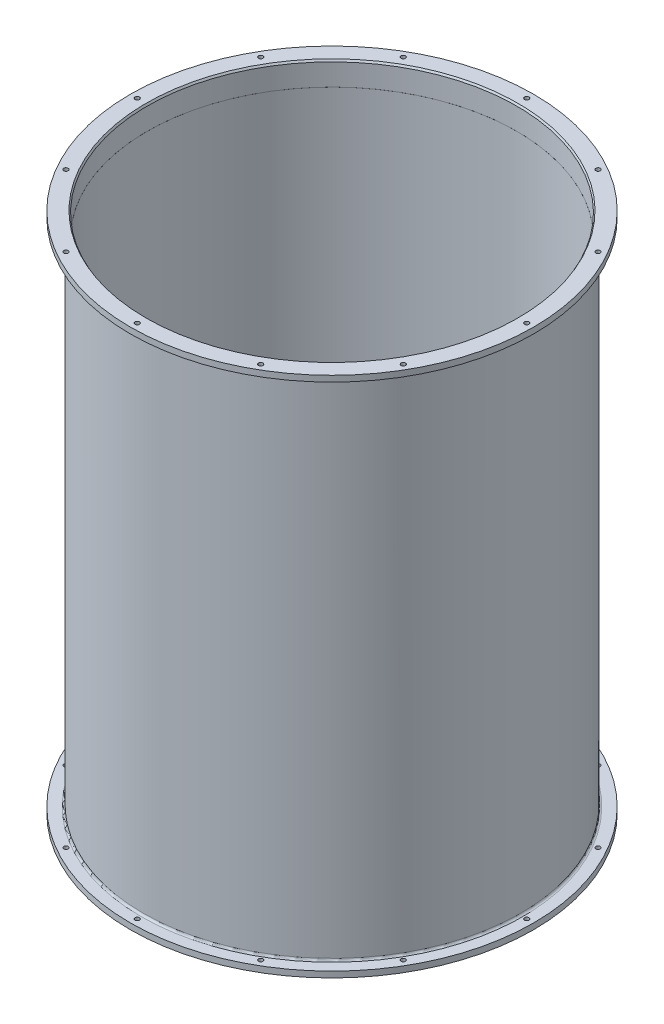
ISO-10303-21;
HEADER;
FILE_DESCRIPTION(('STEP AP214'),'2;1');
FILE_NAME('part.step','',(''),(''),'','','');
FILE_SCHEMA(('AUTOMOTIVE_DESIGN { 1 0 10303 214 1 1 1 1 }'));
ENDSEC;
DATA;
#1=APPLICATION_CONTEXT('core data for automotive mechanical design processes');
#2=APPLICATION_PROTOCOL_DEFINITION('international standard','automotive_design',2000,#1);
#3=PRODUCT_CONTEXT('',#1,'mechanical');
#4=PRODUCT('Part','Part','',(#3));
#5=PRODUCT_RELATED_PRODUCT_CATEGORY('part','',(#4));
#6=PRODUCT_DEFINITION_FORMATION('','',#4);
#7=PRODUCT_DEFINITION_CONTEXT('part definition',#1,'design');
#8=PRODUCT_DEFINITION('design','',#6,#7);
#9=PRODUCT_DEFINITION_SHAPE('','',#8);
#10=(LENGTH_UNIT() NAMED_UNIT(*) SI_UNIT(.MILLI.,.METRE.));
#11=(NAMED_UNIT(*) PLANE_ANGLE_UNIT() SI_UNIT($,.RADIAN.));
#12=(NAMED_UNIT(*) SI_UNIT($,.STERADIAN.) SOLID_ANGLE_UNIT());
#13=UNCERTAINTY_MEASURE_WITH_UNIT(LENGTH_MEASURE(1.E-05),#10,'distance_accuracy_value','');
#14=(GEOMETRIC_REPRESENTATION_CONTEXT(3) GLOBAL_UNCERTAINTY_ASSIGNED_CONTEXT((#13)) GLOBAL_UNIT_ASSIGNED_CONTEXT((#10,
#11,#12)) REPRESENTATION_CONTEXT('',''));
#15=CARTESIAN_POINT('',(0.,0.,0.));
#16=DIRECTION('',(0.,0.,1.));
#17=DIRECTION('',(1.,0.,0.));
#18=AXIS2_PLACEMENT_3D('',#15,#16,#17);
#19=CARTESIAN_POINT('',(0.,86.36,0.));
#20=DIRECTION('',(0.,1.,0.));
#21=DIRECTION('',(0.,0.,1.));
#22=AXIS2_PLACEMENT_3D('',#19,#20,#21);
#23=CYLINDRICAL_SURFACE('',#22,296.926);
#24=CARTESIAN_POINT('',(0.,-416.052,0.));
#25=DIRECTION('',(0.,-1.,0.));
#26=DIRECTION('',(0.,0.,-1.));
#27=AXIS2_PLACEMENT_3D('',#24,#25,#26);
#28=CIRCLE('',#27,296.926);
#29=CARTESIAN_POINT('',(0.,-416.052,-296.926));
#30=VERTEX_POINT('',#29);
#31=EDGE_CURVE('E59',#30,#30,#28,.T.);
#32=ORIENTED_EDGE('',*,*,#31,.T.);
#33=EDGE_LOOP('',(#32));
#34=FACE_BOUND('',#33,.T.);
#35=CARTESIAN_POINT('',(0.,-381.,0.));
#36=DIRECTION('',(0.,1.,0.));
#37=DIRECTION('',(0.,0.,1.));
#38=AXIS2_PLACEMENT_3D('',#35,#36,#37);
#39=CIRCLE('',#38,296.926);
#40=CARTESIAN_POINT('',(0.,-381.,296.926));
#41=VERTEX_POINT('',#40);
#42=EDGE_CURVE('E86',#41,#41,#39,.T.);
#43=ORIENTED_EDGE('',*,*,#42,.T.);
#44=EDGE_LOOP('',(#43));
#45=FACE_BOUND('',#44,.T.);
#46=ADVANCED_FACE('F34',(#34,#45),#23,.F.);
#47=CARTESIAN_POINT('',(-296.926,-419.1,0.));
#48=DIRECTION('',(0.,-1.,0.));
#49=DIRECTION('',(0.,0.,-1.));
#50=AXIS2_PLACEMENT_3D('',#47,#48,#49);
#51=PLANE('',#50);
#52=CARTESIAN_POINT('',(0.,-419.1,0.));
#53=DIRECTION('',(0.,-1.,0.));
#54=DIRECTION('',(0.,0.,-1.));
#55=AXIS2_PLACEMENT_3D('',#52,#53,#54);
#56=CIRCLE('',#55,298.68576362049);
#57=CARTESIAN_POINT('',(0.,-419.1,-298.68576362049));
#58=VERTEX_POINT('',#57);
#59=EDGE_CURVE('E62',#58,#58,#56,.F.);
#60=ORIENTED_EDGE('',*,*,#59,.T.);
#61=EDGE_LOOP('',(#60));
#62=FACE_BOUND('',#61,.T.);
#63=CARTESIAN_POINT('',(156.368749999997,-419.1,270.838619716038));
#64=DIRECTION('',(0.,1.,0.));
#65=DIRECTION('',(0.499999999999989,0.,0.866025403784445));
#66=AXIS2_PLACEMENT_3D('',#63,#64,#65);
#67=CIRCLE('',#66,3.55599999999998);
#68=CARTESIAN_POINT('',(158.146749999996,-419.1,273.918206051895));
#69=VERTEX_POINT('',#68);
#70=EDGE_CURVE('E227',#69,#69,#67,.T.);
#71=ORIENTED_EDGE('',*,*,#70,.T.);
#72=EDGE_LOOP('',(#71));
#73=FACE_BOUND('',#72,.T.);
#74=CARTESIAN_POINT('',(270.838619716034,-419.1,156.368750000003));
#75=DIRECTION('',(0.,1.,0.));
#76=DIRECTION('',(0.866025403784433,0.,0.50000000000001));
#77=AXIS2_PLACEMENT_3D('',#74,#75,#76);
#78=CIRCLE('',#77,3.55599999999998);
#79=CARTESIAN_POINT('',(273.918206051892,-419.1,158.146750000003));
#80=VERTEX_POINT('',#79);
#81=EDGE_CURVE('E215',#80,#80,#78,.T.);
#82=ORIENTED_EDGE('',*,*,#81,.T.);
#83=EDGE_LOOP('',(#82));
#84=FACE_BOUND('',#83,.T.);
#85=CARTESIAN_POINT('',(312.7375,-419.1,3.27575333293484E-12));
#86=DIRECTION('',(0.,1.,0.));
#87=DIRECTION('',(1.,0.,0.));
#88=AXIS2_PLACEMENT_3D('',#85,#86,#87);
#89=CIRCLE('',#88,3.55599999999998);
#90=CARTESIAN_POINT('',(316.2935,-419.1,3.31300047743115E-12));
#91=VERTEX_POINT('',#90);
#92=EDGE_CURVE('E203',#91,#91,#89,.T.);
#93=ORIENTED_EDGE('',*,*,#92,.T.);
#94=EDGE_LOOP('',(#93));
#95=FACE_BOUND('',#94,.T.);
#96=CARTESIAN_POINT('',(270.838619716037,-419.1,-156.368749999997));
#97=DIRECTION('',(0.,1.,0.));
#98=DIRECTION('',(0.866025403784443,0.,-0.499999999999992));
#99=AXIS2_PLACEMENT_3D('',#96,#97,#98);
#100=CIRCLE('',#99,3.55599999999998);
#101=CARTESIAN_POINT('',(273.918206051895,-419.1,-158.146749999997));
#102=VERTEX_POINT('',#101);
#103=EDGE_CURVE('E191',#102,#102,#100,.T.);
#104=ORIENTED_EDGE('',*,*,#103,.T.);
#105=EDGE_LOOP('',(#104));
#106=FACE_BOUND('',#105,.T.);
#107=CARTESIAN_POINT('',(156.368750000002,-419.1,-270.838619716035));
#108=DIRECTION('',(0.,1.,0.));
#109=DIRECTION('',(0.500000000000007,0.,-0.866025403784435));
#110=AXIS2_PLACEMENT_3D('',#107,#108,#109);
#111=CIRCLE('',#110,3.55599999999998);
#112=CARTESIAN_POINT('',(158.146750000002,-419.1,-273.918206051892));
#113=VERTEX_POINT('',#112);
#114=EDGE_CURVE('E179',#113,#113,#111,.T.);
#115=ORIENTED_EDGE('',*,*,#114,.T.);
#116=EDGE_LOOP('',(#115));
#117=FACE_BOUND('',#116,.T.);
#118=CARTESIAN_POINT('',(2.18383555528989E-12,-419.1,-312.7375));
#119=DIRECTION('',(0.,1.,0.));
#120=DIRECTION('',(0.,0.,-1.));
#121=AXIS2_PLACEMENT_3D('',#118,#119,#120);
#122=CIRCLE('',#121,3.55599999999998);
#123=CARTESIAN_POINT('',(2.2086669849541E-12,-419.1,-316.2935));
#124=VERTEX_POINT('',#123);
#125=EDGE_CURVE('E167',#124,#124,#122,.T.);
#126=ORIENTED_EDGE('',*,*,#125,.T.);
#127=EDGE_LOOP('',(#126));
#128=FACE_BOUND('',#127,.T.);
#129=CARTESIAN_POINT('',(-156.368749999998,-419.1,-270.838619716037));
#130=DIRECTION('',(0.,1.,0.));
#131=DIRECTION('',(-0.499999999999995,0.,-0.866025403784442));
#132=AXIS2_PLACEMENT_3D('',#129,#130,#131);
#133=CIRCLE('',#132,3.55599999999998);
#134=CARTESIAN_POINT('',(-158.146749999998,-419.1,-273.918206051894));
#135=VERTEX_POINT('',#134);
#136=EDGE_CURVE('E155',#135,#135,#133,.T.);
#137=ORIENTED_EDGE('',*,*,#136,.T.);
#138=EDGE_LOOP('',(#137));
#139=FACE_BOUND('',#138,.T.);
#140=CARTESIAN_POINT('',(-270.838619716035,-419.1,-156.368750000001));
#141=DIRECTION('',(0.,1.,0.));
#142=DIRECTION('',(-0.866025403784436,0.,-0.500000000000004));
#143=AXIS2_PLACEMENT_3D('',#140,#141,#142);
#144=CIRCLE('',#143,3.55599999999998);
#145=CARTESIAN_POINT('',(-273.918206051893,-419.1,-158.146750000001));
#146=VERTEX_POINT('',#145);
#147=EDGE_CURVE('E143',#146,#146,#144,.T.);
#148=ORIENTED_EDGE('',*,*,#147,.T.);
#149=EDGE_LOOP('',(#148));
#150=FACE_BOUND('',#149,.T.);
#151=CARTESIAN_POINT('',(-312.7375,-419.1,-1.09191777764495E-12));
#152=DIRECTION('',(0.,1.,0.));
#153=DIRECTION('',(-1.,0.,0.));
#154=AXIS2_PLACEMENT_3D('',#151,#152,#153);
#155=CIRCLE('',#154,3.55599999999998);
#156=CARTESIAN_POINT('',(-316.2935,-419.1,-1.10433349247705E-12));
#157=VERTEX_POINT('',#156);
#158=EDGE_CURVE('E131',#157,#157,#155,.T.);
#159=ORIENTED_EDGE('',*,*,#158,.T.);
#160=EDGE_LOOP('',(#159));
#161=FACE_BOUND('',#160,.T.);
#162=CARTESIAN_POINT('',(-270.838619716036,-419.1,156.368749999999));
#163=DIRECTION('',(0.,1.,0.));
#164=DIRECTION('',(-0.86602540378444,0.,0.499999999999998));
#165=AXIS2_PLACEMENT_3D('',#162,#163,#164);
#166=CIRCLE('',#165,3.55599999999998);
#167=CARTESIAN_POINT('',(-273.918206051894,-419.1,158.146749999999));
#168=VERTEX_POINT('',#167);
#169=EDGE_CURVE('E119',#168,#168,#166,.T.);
#170=ORIENTED_EDGE('',*,*,#169,.T.);
#171=EDGE_LOOP('',(#170));
#172=FACE_BOUND('',#171,.T.);
#173=CARTESIAN_POINT('',(-156.36875,-419.1,270.838619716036));
#174=DIRECTION('',(0.,1.,0.));
#175=DIRECTION('',(-0.500000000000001,0.,0.866025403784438));
#176=AXIS2_PLACEMENT_3D('',#173,#174,#175);
#177=CIRCLE('',#176,3.55599999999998);
#178=CARTESIAN_POINT('',(-158.14675,-419.1,273.918206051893));
#179=VERTEX_POINT('',#178);
#180=EDGE_CURVE('E107',#179,#179,#177,.T.);
#181=ORIENTED_EDGE('',*,*,#180,.T.);
#182=EDGE_LOOP('',(#181));
#183=FACE_BOUND('',#182,.T.);
#184=CARTESIAN_POINT('',(0.,-419.1,312.7375));
#185=DIRECTION('',(0.,1.,0.));
#186=DIRECTION('',(0.,0.,1.));
#187=AXIS2_PLACEMENT_3D('',#184,#185,#186);
#188=CIRCLE('',#187,3.55599999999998);
#189=CARTESIAN_POINT('',(0.,-419.1,316.2935));
#190=VERTEX_POINT('',#189);
#191=EDGE_CURVE('E95',#190,#190,#188,.T.);
#192=ORIENTED_EDGE('',*,*,#191,.T.);
#193=EDGE_LOOP('',(#192));
#194=FACE_BOUND('',#193,.T.);
#195=CARTESIAN_POINT('',(0.,-419.1,0.));
#196=DIRECTION('',(0.,1.,0.));
#197=DIRECTION('',(0.,0.,1.));
#198=AXIS2_PLACEMENT_3D('',#195,#196,#197);
#199=CIRCLE('',#198,323.85);
#200=CARTESIAN_POINT('',(0.,-419.1,323.85));
#201=VERTEX_POINT('',#200);
#202=EDGE_CURVE('E65',#201,#201,#199,.T.);
#203=ORIENTED_EDGE('',*,*,#202,.F.);
#204=EDGE_LOOP('',(#203));
#205=FACE_BOUND('',#204,.T.);
#206=ADVANCED_FACE('F277',(#62,#73,#84,#95,#106,#117,#128,#139,#150,#161,#172,#183,#194,#205),
#51,.T.);
#207=CARTESIAN_POINT('',(0.,86.36,0.));
#208=DIRECTION('',(0.,1.,0.));
#209=DIRECTION('',(0.,0.,1.));
#210=AXIS2_PLACEMENT_3D('',#207,#208,#209);
#211=CYLINDRICAL_SURFACE('',#210,323.85);
#212=ORIENTED_EDGE('',*,*,#202,.T.);
#213=EDGE_LOOP('',(#212));
#214=FACE_BOUND('',#213,.T.);
#215=CARTESIAN_POINT('',(0.,-409.575,0.));
#216=DIRECTION('',(0.,1.,0.));
#217=DIRECTION('',(0.,0.,1.));
#218=AXIS2_PLACEMENT_3D('',#215,#216,#217);
#219=CIRCLE('',#218,323.85);
#220=CARTESIAN_POINT('',(0.,-409.575,323.85));
#221=VERTEX_POINT('',#220);
#222=EDGE_CURVE('E68',#221,#221,#219,.T.);
#223=ORIENTED_EDGE('',*,*,#222,.F.);
#224=EDGE_LOOP('',(#223));
#225=FACE_BOUND('',#224,.T.);
#226=ADVANCED_FACE('F282',(#214,#225),#211,.T.);
#227=CARTESIAN_POINT('',(-323.85,-409.575,0.));
#228=DIRECTION('',(0.,1.,0.));
#229=DIRECTION('',(0.,0.,1.));
#230=AXIS2_PLACEMENT_3D('',#227,#228,#229);
#231=PLANE('',#230);
#232=CARTESIAN_POINT('',(0.,-409.575,0.));
#233=DIRECTION('',(0.,1.,0.));
#234=DIRECTION('',(0.,0.,1.));
#235=AXIS2_PLACEMENT_3D('',#232,#233,#234);
#236=CIRCLE('',#235,306.3875);
#237=CARTESIAN_POINT('',(0.,-409.575,306.3875));
#238=VERTEX_POINT('',#237);
#239=EDGE_CURVE('E44',#238,#238,#236,.F.);
#240=ORIENTED_EDGE('',*,*,#239,.T.);
#241=EDGE_LOOP('',(#240));
#242=FACE_BOUND('',#241,.T.);
#243=CARTESIAN_POINT('',(156.368749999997,-409.575,270.838619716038));
#244=DIRECTION('',(0.,1.,0.));
#245=DIRECTION('',(0.,0.,1.));
#246=AXIS2_PLACEMENT_3D('',#243,#244,#245);
#247=CIRCLE('',#246,3.55599999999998);
#248=CARTESIAN_POINT('',(156.368749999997,-409.575,274.394619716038));
#249=VERTEX_POINT('',#248);
#250=EDGE_CURVE('E221',#249,#249,#247,.T.);
#251=ORIENTED_EDGE('',*,*,#250,.F.);
#252=EDGE_LOOP('',(#251));
#253=FACE_BOUND('',#252,.T.);
#254=CARTESIAN_POINT('',(270.838619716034,-409.575,156.368750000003));
#255=DIRECTION('',(0.,1.,0.));
#256=DIRECTION('',(0.,0.,1.));
#257=AXIS2_PLACEMENT_3D('',#254,#255,#256);
#258=CIRCLE('',#257,3.55599999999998);
#259=CARTESIAN_POINT('',(270.838619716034,-409.575,159.924750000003));
#260=VERTEX_POINT('',#259);
#261=EDGE_CURVE('E209',#260,#260,#258,.T.);
#262=ORIENTED_EDGE('',*,*,#261,.F.);
#263=EDGE_LOOP('',(#262));
#264=FACE_BOUND('',#263,.T.);
#265=CARTESIAN_POINT('',(312.7375,-409.575,3.27575333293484E-12));
#266=DIRECTION('',(0.,1.,0.));
#267=DIRECTION('',(0.,0.,1.));
#268=AXIS2_PLACEMENT_3D('',#265,#266,#267);
#269=CIRCLE('',#268,3.55599999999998);
#270=CARTESIAN_POINT('',(312.7375,-409.575,3.55600000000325));
#271=VERTEX_POINT('',#270);
#272=EDGE_CURVE('E197',#271,#271,#269,.T.);
#273=ORIENTED_EDGE('',*,*,#272,.F.);
#274=EDGE_LOOP('',(#273));
#275=FACE_BOUND('',#274,.T.);
#276=CARTESIAN_POINT('',(270.838619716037,-409.575,-156.368749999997));
#277=DIRECTION('',(0.,1.,0.));
#278=DIRECTION('',(0.,0.,1.));
#279=AXIS2_PLACEMENT_3D('',#276,#277,#278);
#280=CIRCLE('',#279,3.55599999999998);
#281=CARTESIAN_POINT('',(270.838619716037,-409.575,-152.812749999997));
#282=VERTEX_POINT('',#281);
#283=EDGE_CURVE('E185',#282,#282,#280,.T.);
#284=ORIENTED_EDGE('',*,*,#283,.F.);
#285=EDGE_LOOP('',(#284));
#286=FACE_BOUND('',#285,.T.);
#287=CARTESIAN_POINT('',(156.368750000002,-409.575,-270.838619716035));
#288=DIRECTION('',(0.,1.,0.));
#289=DIRECTION('',(0.,0.,1.));
#290=AXIS2_PLACEMENT_3D('',#287,#288,#289);
#291=CIRCLE('',#290,3.55599999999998);
#292=CARTESIAN_POINT('',(156.368750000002,-409.575,-267.282619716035));
#293=VERTEX_POINT('',#292);
#294=EDGE_CURVE('E173',#293,#293,#291,.T.);
#295=ORIENTED_EDGE('',*,*,#294,.F.);
#296=EDGE_LOOP('',(#295));
#297=FACE_BOUND('',#296,.T.);
#298=CARTESIAN_POINT('',(2.18383555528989E-12,-409.575,-312.7375));
#299=DIRECTION('',(0.,1.,0.));
#300=DIRECTION('',(0.,0.,1.));
#301=AXIS2_PLACEMENT_3D('',#298,#299,#300);
#302=CIRCLE('',#301,3.55599999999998);
#303=CARTESIAN_POINT('',(2.18383555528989E-12,-409.575,-309.1815));
#304=VERTEX_POINT('',#303);
#305=EDGE_CURVE('E161',#304,#304,#302,.T.);
#306=ORIENTED_EDGE('',*,*,#305,.F.);
#307=EDGE_LOOP('',(#306));
#308=FACE_BOUND('',#307,.T.);
#309=CARTESIAN_POINT('',(-156.368749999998,-409.575,-270.838619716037));
#310=DIRECTION('',(0.,1.,0.));
#311=DIRECTION('',(0.,0.,1.));
#312=AXIS2_PLACEMENT_3D('',#309,#310,#311);
#313=CIRCLE('',#312,3.55599999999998);
#314=CARTESIAN_POINT('',(-156.368749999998,-409.575,-267.282619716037));
#315=VERTEX_POINT('',#314);
#316=EDGE_CURVE('E149',#315,#315,#313,.T.);
#317=ORIENTED_EDGE('',*,*,#316,.F.);
#318=EDGE_LOOP('',(#317));
#319=FACE_BOUND('',#318,.T.);
#320=CARTESIAN_POINT('',(-270.838619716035,-409.575,-156.368750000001));
#321=DIRECTION('',(0.,1.,0.));
#322=DIRECTION('',(0.,0.,1.));
#323=AXIS2_PLACEMENT_3D('',#320,#321,#322);
#324=CIRCLE('',#323,3.55599999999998);
#325=CARTESIAN_POINT('',(-270.838619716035,-409.575,-152.812750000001));
#326=VERTEX_POINT('',#325);
#327=EDGE_CURVE('E137',#326,#326,#324,.T.);
#328=ORIENTED_EDGE('',*,*,#327,.F.);
#329=EDGE_LOOP('',(#328));
#330=FACE_BOUND('',#329,.T.);
#331=CARTESIAN_POINT('',(-312.7375,-409.575,-1.09191777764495E-12));
#332=DIRECTION('',(0.,1.,0.));
#333=DIRECTION('',(0.,0.,1.));
#334=AXIS2_PLACEMENT_3D('',#331,#332,#333);
#335=CIRCLE('',#334,3.55599999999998);
#336=CARTESIAN_POINT('',(-312.7375,-409.575,3.55599999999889));
#337=VERTEX_POINT('',#336);
#338=EDGE_CURVE('E125',#337,#337,#335,.T.);
#339=ORIENTED_EDGE('',*,*,#338,.F.);
#340=EDGE_LOOP('',(#339));
#341=FACE_BOUND('',#340,.T.);
#342=CARTESIAN_POINT('',(-270.838619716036,-409.575,156.368749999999));
#343=DIRECTION('',(0.,1.,0.));
#344=DIRECTION('',(0.,0.,1.));
#345=AXIS2_PLACEMENT_3D('',#342,#343,#344);
#346=CIRCLE('',#345,3.55599999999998);
#347=CARTESIAN_POINT('',(-270.838619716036,-409.575,159.924749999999));
#348=VERTEX_POINT('',#347);
#349=EDGE_CURVE('E113',#348,#348,#346,.T.);
#350=ORIENTED_EDGE('',*,*,#349,.F.);
#351=EDGE_LOOP('',(#350));
#352=FACE_BOUND('',#351,.T.);
#353=CARTESIAN_POINT('',(-156.36875,-409.575,270.838619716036));
#354=DIRECTION('',(0.,1.,0.));
#355=DIRECTION('',(0.,0.,1.));
#356=AXIS2_PLACEMENT_3D('',#353,#354,#355);
#357=CIRCLE('',#356,3.55599999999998);
#358=CARTESIAN_POINT('',(-156.36875,-409.575,274.394619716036));
#359=VERTEX_POINT('',#358);
#360=EDGE_CURVE('E101',#359,#359,#357,.T.);
#361=ORIENTED_EDGE('',*,*,#360,.F.);
#362=EDGE_LOOP('',(#361));
#363=FACE_BOUND('',#362,.T.);
#364=CARTESIAN_POINT('',(0.,-409.575,312.7375));
#365=DIRECTION('',(0.,1.,0.));
#366=DIRECTION('',(0.,0.,1.));
#367=AXIS2_PLACEMENT_3D('',#364,#365,#366);
#368=CIRCLE('',#367,3.55599999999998);
#369=CARTESIAN_POINT('',(0.,-409.575,316.2935));
#370=VERTEX_POINT('',#369);
#371=EDGE_CURVE('E89',#370,#370,#368,.T.);
#372=ORIENTED_EDGE('',*,*,#371,.F.);
#373=EDGE_LOOP('',(#372));
#374=FACE_BOUND('',#373,.T.);
#375=ORIENTED_EDGE('',*,*,#222,.T.);
#376=EDGE_LOOP('',(#375));
#377=FACE_BOUND('',#376,.T.);
#378=ADVANCED_FACE('F603',(#242,#253,#264,#275,#286,#297,#308,#319,#330,#341,#352,#363,#374,
#377),#231,.T.);
#379=CARTESIAN_POINT('',(0.,86.36,0.));
#380=DIRECTION('',(0.,1.,0.));
#381=DIRECTION('',(0.,0.,1.));
#382=AXIS2_PLACEMENT_3D('',#379,#380,#381);
#383=CYLINDRICAL_SURFACE('',#382,303.2125);
#384=CARTESIAN_POINT('',(0.,-406.4,0.));
#385=DIRECTION('',(0.,1.,0.));
#386=DIRECTION('',(0.,0.,1.));
#387=AXIS2_PLACEMENT_3D('',#384,#385,#386);
#388=CIRCLE('',#387,303.2125);
#389=CARTESIAN_POINT('',(0.,-406.4,303.2125));
#390=VERTEX_POINT('',#389);
#391=EDGE_CURVE('E48',#390,#390,#388,.T.);
#392=ORIENTED_EDGE('',*,*,#391,.T.);
#393=EDGE_LOOP('',(#392));
#394=FACE_BOUND('',#393,.T.);
#395=CARTESIAN_POINT('',(0.,406.4,0.));
#396=DIRECTION('',(0.,-1.,0.));
#397=DIRECTION('',(0.,0.,-1.));
#398=AXIS2_PLACEMENT_3D('',#395,#396,#397);
#399=CIRCLE('',#398,303.2125);
#400=CARTESIAN_POINT('',(0.,406.4,-303.2125));
#401=VERTEX_POINT('',#400);
#402=EDGE_CURVE('E53',#401,#401,#399,.T.);
#403=ORIENTED_EDGE('',*,*,#402,.T.);
#404=EDGE_LOOP('',(#403));
#405=FACE_BOUND('',#404,.T.);
#406=ADVANCED_FACE('F273',(#394,#405),#383,.T.);
#407=CARTESIAN_POINT('',(-323.85,409.575,0.));
#408=DIRECTION('',(0.,-1.,0.));
#409=DIRECTION('',(0.,0.,-1.));
#410=AXIS2_PLACEMENT_3D('',#407,#408,#409);
#411=PLANE('',#410);
#412=CARTESIAN_POINT('',(0.,409.575,0.));
#413=DIRECTION('',(0.,-1.,0.));
#414=DIRECTION('',(0.,0.,-1.));
#415=AXIS2_PLACEMENT_3D('',#412,#413,#414);
#416=CIRCLE('',#415,306.3875);
#417=CARTESIAN_POINT('',(0.,409.575,-306.3875));
#418=VERTEX_POINT('',#417);
#419=EDGE_CURVE('E56',#418,#418,#416,.F.);
#420=ORIENTED_EDGE('',*,*,#419,.T.);
#421=EDGE_LOOP('',(#420));
#422=FACE_BOUND('',#421,.T.);
#423=CARTESIAN_POINT('',(156.368749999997,409.575,270.838619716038));
#424=DIRECTION('',(0.,-1.,0.));
#425=DIRECTION('',(0.,0.,-1.));
#426=AXIS2_PLACEMENT_3D('',#423,#424,#425);
#427=CIRCLE('',#426,3.55599999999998);
#428=CARTESIAN_POINT('',(156.368749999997,409.575,267.282619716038));
#429=VERTEX_POINT('',#428);
#430=EDGE_CURVE('E224',#429,#429,#427,.T.);
#431=ORIENTED_EDGE('',*,*,#430,.F.);
#432=EDGE_LOOP('',(#431));
#433=FACE_BOUND('',#432,.T.);
#434=CARTESIAN_POINT('',(270.838619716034,409.575,156.368750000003));
#435=DIRECTION('',(0.,-1.,0.));
#436=DIRECTION('',(0.,0.,-1.));
#437=AXIS2_PLACEMENT_3D('',#434,#435,#436);
#438=CIRCLE('',#437,3.55599999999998);
#439=CARTESIAN_POINT('',(270.838619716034,409.575,152.812750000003));
#440=VERTEX_POINT('',#439);
#441=EDGE_CURVE('E212',#440,#440,#438,.T.);
#442=ORIENTED_EDGE('',*,*,#441,.F.);
#443=EDGE_LOOP('',(#442));
#444=FACE_BOUND('',#443,.T.);
#445=CARTESIAN_POINT('',(312.7375,409.575,3.27575333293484E-12));
#446=DIRECTION('',(0.,-1.,0.));
#447=DIRECTION('',(0.,0.,-1.));
#448=AXIS2_PLACEMENT_3D('',#445,#446,#447);
#449=CIRCLE('',#448,3.55599999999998);
#450=CARTESIAN_POINT('',(312.7375,409.575,-3.5559999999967));
#451=VERTEX_POINT('',#450);
#452=EDGE_CURVE('E200',#451,#451,#449,.T.);
#453=ORIENTED_EDGE('',*,*,#452,.F.);
#454=EDGE_LOOP('',(#453));
#455=FACE_BOUND('',#454,.T.);
#456=CARTESIAN_POINT('',(270.838619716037,409.575,-156.368749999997));
#457=DIRECTION('',(0.,-1.,0.));
#458=DIRECTION('',(0.,0.,-1.));
#459=AXIS2_PLACEMENT_3D('',#456,#457,#458);
#460=CIRCLE('',#459,3.55599999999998);
#461=CARTESIAN_POINT('',(270.838619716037,409.575,-159.924749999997));
#462=VERTEX_POINT('',#461);
#463=EDGE_CURVE('E188',#462,#462,#460,.T.);
#464=ORIENTED_EDGE('',*,*,#463,.F.);
#465=EDGE_LOOP('',(#464));
#466=FACE_BOUND('',#465,.T.);
#467=CARTESIAN_POINT('',(156.368750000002,409.575,-270.838619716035));
#468=DIRECTION('',(0.,-1.,0.));
#469=DIRECTION('',(0.,0.,-1.));
#470=AXIS2_PLACEMENT_3D('',#467,#468,#469);
#471=CIRCLE('',#470,3.55599999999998);
#472=CARTESIAN_POINT('',(156.368750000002,409.575,-274.394619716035));
#473=VERTEX_POINT('',#472);
#474=EDGE_CURVE('E176',#473,#473,#471,.T.);
#475=ORIENTED_EDGE('',*,*,#474,.F.);
#476=EDGE_LOOP('',(#475));
#477=FACE_BOUND('',#476,.T.);
#478=CARTESIAN_POINT('',(2.18383555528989E-12,409.575,-312.7375));
#479=DIRECTION('',(0.,-1.,0.));
#480=DIRECTION('',(0.,0.,-1.));
#481=AXIS2_PLACEMENT_3D('',#478,#479,#480);
#482=CIRCLE('',#481,3.55599999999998);
#483=CARTESIAN_POINT('',(2.18383555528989E-12,409.575,-316.2935));
#484=VERTEX_POINT('',#483);
#485=EDGE_CURVE('E164',#484,#484,#482,.T.);
#486=ORIENTED_EDGE('',*,*,#485,.F.);
#487=EDGE_LOOP('',(#486));
#488=FACE_BOUND('',#487,.T.);
#489=CARTESIAN_POINT('',(-156.368749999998,409.575,-270.838619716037));
#490=DIRECTION('',(0.,-1.,0.));
#491=DIRECTION('',(0.,0.,-1.));
#492=AXIS2_PLACEMENT_3D('',#489,#490,#491);
#493=CIRCLE('',#492,3.55599999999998);
#494=CARTESIAN_POINT('',(-156.368749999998,409.575,-274.394619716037));
#495=VERTEX_POINT('',#494);
#496=EDGE_CURVE('E152',#495,#495,#493,.T.);
#497=ORIENTED_EDGE('',*,*,#496,.F.);
#498=EDGE_LOOP('',(#497));
#499=FACE_BOUND('',#498,.T.);
#500=CARTESIAN_POINT('',(-270.838619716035,409.575,-156.368750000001));
#501=DIRECTION('',(0.,-1.,0.));
#502=DIRECTION('',(0.,0.,-1.));
#503=AXIS2_PLACEMENT_3D('',#500,#501,#502);
#504=CIRCLE('',#503,3.55599999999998);
#505=CARTESIAN_POINT('',(-270.838619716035,409.575,-159.924750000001));
#506=VERTEX_POINT('',#505);
#507=EDGE_CURVE('E140',#506,#506,#504,.T.);
#508=ORIENTED_EDGE('',*,*,#507,.F.);
#509=EDGE_LOOP('',(#508));
#510=FACE_BOUND('',#509,.T.);
#511=CARTESIAN_POINT('',(-312.7375,409.575,-1.09191777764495E-12));
#512=DIRECTION('',(0.,-1.,0.));
#513=DIRECTION('',(0.,0.,-1.));
#514=AXIS2_PLACEMENT_3D('',#511,#512,#513);
#515=CIRCLE('',#514,3.55599999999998);
#516=CARTESIAN_POINT('',(-312.7375,409.575,-3.55600000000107));
#517=VERTEX_POINT('',#516);
#518=EDGE_CURVE('E128',#517,#517,#515,.T.);
#519=ORIENTED_EDGE('',*,*,#518,.F.);
#520=EDGE_LOOP('',(#519));
#521=FACE_BOUND('',#520,.T.);
#522=CARTESIAN_POINT('',(-270.838619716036,409.575,156.368749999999));
#523=DIRECTION('',(0.,-1.,0.));
#524=DIRECTION('',(0.,0.,-1.));
#525=AXIS2_PLACEMENT_3D('',#522,#523,#524);
#526=CIRCLE('',#525,3.55599999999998);
#527=CARTESIAN_POINT('',(-270.838619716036,409.575,152.812749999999));
#528=VERTEX_POINT('',#527);
#529=EDGE_CURVE('E116',#528,#528,#526,.T.);
#530=ORIENTED_EDGE('',*,*,#529,.F.);
#531=EDGE_LOOP('',(#530));
#532=FACE_BOUND('',#531,.T.);
#533=CARTESIAN_POINT('',(-156.36875,409.575,270.838619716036));
#534=DIRECTION('',(0.,-1.,0.));
#535=DIRECTION('',(0.,0.,-1.));
#536=AXIS2_PLACEMENT_3D('',#533,#534,#535);
#537=CIRCLE('',#536,3.55599999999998);
#538=CARTESIAN_POINT('',(-156.36875,409.575,267.282619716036));
#539=VERTEX_POINT('',#538);
#540=EDGE_CURVE('E104',#539,#539,#537,.T.);
#541=ORIENTED_EDGE('',*,*,#540,.F.);
#542=EDGE_LOOP('',(#541));
#543=FACE_BOUND('',#542,.T.);
#544=CARTESIAN_POINT('',(0.,409.575,312.7375));
#545=DIRECTION('',(0.,-1.,0.));
#546=DIRECTION('',(0.,0.,-1.));
#547=AXIS2_PLACEMENT_3D('',#544,#545,#546);
#548=CIRCLE('',#547,3.55599999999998);
#549=CARTESIAN_POINT('',(0.,409.575,309.1815));
#550=VERTEX_POINT('',#549);
#551=EDGE_CURVE('E92',#550,#550,#548,.T.);
#552=ORIENTED_EDGE('',*,*,#551,.F.);
#553=EDGE_LOOP('',(#552));
#554=FACE_BOUND('',#553,.T.);
#555=CARTESIAN_POINT('',(0.,409.575,0.));
#556=DIRECTION('',(0.,1.,0.));
#557=DIRECTION('',(0.,0.,1.));
#558=AXIS2_PLACEMENT_3D('',#555,#556,#557);
#559=CIRCLE('',#558,323.85);
#560=CARTESIAN_POINT('',(0.,409.575,323.85));
#561=VERTEX_POINT('',#560);
#562=EDGE_CURVE('E71',#561,#561,#559,.T.);
#563=ORIENTED_EDGE('',*,*,#562,.F.);
#564=EDGE_LOOP('',(#563));
#565=FACE_BOUND('',#564,.T.);
#566=ADVANCED_FACE('F267',(#422,#433,#444,#455,#466,#477,#488,#499,#510,#521,#532,#543,#554,
#565),#411,.T.);
#567=CARTESIAN_POINT('',(0.,86.36,0.));
#568=DIRECTION('',(0.,1.,0.));
#569=DIRECTION('',(0.,0.,1.));
#570=AXIS2_PLACEMENT_3D('',#567,#568,#569);
#571=CYLINDRICAL_SURFACE('',#570,323.85);
#572=ORIENTED_EDGE('',*,*,#562,.T.);
#573=EDGE_LOOP('',(#572));
#574=FACE_BOUND('',#573,.T.);
#575=CARTESIAN_POINT('',(0.,419.1,0.));
#576=DIRECTION('',(0.,1.,0.));
#577=DIRECTION('',(0.,0.,1.));
#578=AXIS2_PLACEMENT_3D('',#575,#576,#577);
#579=CIRCLE('',#578,323.85);
#580=CARTESIAN_POINT('',(0.,419.1,323.85));
#581=VERTEX_POINT('',#580);
#582=EDGE_CURVE('E74',#581,#581,#579,.T.);
#583=ORIENTED_EDGE('',*,*,#582,.F.);
#584=EDGE_LOOP('',(#583));
#585=FACE_BOUND('',#584,.T.);
#586=ADVANCED_FACE('F240',(#574,#585),#571,.T.);
#587=CARTESIAN_POINT('',(-323.85,419.1,0.));
#588=DIRECTION('',(0.,1.,0.));
#589=DIRECTION('',(0.,0.,1.));
#590=AXIS2_PLACEMENT_3D('',#587,#588,#589);
#591=PLANE('',#590);
#592=CARTESIAN_POINT('',(0.,419.1,0.));
#593=DIRECTION('',(0.,1.,0.));
#594=DIRECTION('',(0.,0.,1.));
#595=AXIS2_PLACEMENT_3D('',#592,#593,#594);
#596=CIRCLE('',#595,298.68576362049);
#597=CARTESIAN_POINT('',(0.,419.1,298.68576362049));
#598=VERTEX_POINT('',#597);
#599=EDGE_CURVE('E10',#598,#598,#596,.F.);
#600=ORIENTED_EDGE('',*,*,#599,.T.);
#601=EDGE_LOOP('',(#600));
#602=FACE_BOUND('',#601,.T.);
#603=CARTESIAN_POINT('',(156.368749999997,419.1,270.838619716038));
#604=DIRECTION('',(0.,1.,0.));
#605=DIRECTION('',(0.499999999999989,0.,0.866025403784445));
#606=AXIS2_PLACEMENT_3D('',#603,#604,#605);
#607=CIRCLE('',#606,3.55599999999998);
#608=CARTESIAN_POINT('',(158.146749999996,419.1,273.918206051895));
#609=VERTEX_POINT('',#608);
#610=EDGE_CURVE('E230',#609,#609,#607,.T.);
#611=ORIENTED_EDGE('',*,*,#610,.F.);
#612=EDGE_LOOP('',(#611));
#613=FACE_BOUND('',#612,.T.);
#614=CARTESIAN_POINT('',(270.838619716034,419.1,156.368750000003));
#615=DIRECTION('',(0.,1.,0.));
#616=DIRECTION('',(0.866025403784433,0.,0.50000000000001));
#617=AXIS2_PLACEMENT_3D('',#614,#615,#616);
#618=CIRCLE('',#617,3.55599999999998);
#619=CARTESIAN_POINT('',(273.918206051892,419.1,158.146750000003));
#620=VERTEX_POINT('',#619);
#621=EDGE_CURVE('E218',#620,#620,#618,.T.);
#622=ORIENTED_EDGE('',*,*,#621,.F.);
#623=EDGE_LOOP('',(#622));
#624=FACE_BOUND('',#623,.T.);
#625=CARTESIAN_POINT('',(312.7375,419.1,3.27575333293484E-12));
#626=DIRECTION('',(0.,1.,0.));
#627=DIRECTION('',(1.,0.,0.));
#628=AXIS2_PLACEMENT_3D('',#625,#626,#627);
#629=CIRCLE('',#628,3.55599999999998);
#630=CARTESIAN_POINT('',(316.2935,419.1,3.31300047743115E-12));
#631=VERTEX_POINT('',#630);
#632=EDGE_CURVE('E206',#631,#631,#629,.T.);
#633=ORIENTED_EDGE('',*,*,#632,.F.);
#634=EDGE_LOOP('',(#633));
#635=FACE_BOUND('',#634,.T.);
#636=CARTESIAN_POINT('',(270.838619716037,419.1,-156.368749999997));
#637=DIRECTION('',(0.,1.,0.));
#638=DIRECTION('',(0.866025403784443,0.,-0.499999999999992));
#639=AXIS2_PLACEMENT_3D('',#636,#637,#638);
#640=CIRCLE('',#639,3.55599999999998);
#641=CARTESIAN_POINT('',(273.918206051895,419.1,-158.146749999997));
#642=VERTEX_POINT('',#641);
#643=EDGE_CURVE('E194',#642,#642,#640,.T.);
#644=ORIENTED_EDGE('',*,*,#643,.F.);
#645=EDGE_LOOP('',(#644));
#646=FACE_BOUND('',#645,.T.);
#647=CARTESIAN_POINT('',(156.368750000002,419.1,-270.838619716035));
#648=DIRECTION('',(0.,1.,0.));
#649=DIRECTION('',(0.500000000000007,0.,-0.866025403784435));
#650=AXIS2_PLACEMENT_3D('',#647,#648,#649);
#651=CIRCLE('',#650,3.55599999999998);
#652=CARTESIAN_POINT('',(158.146750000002,419.1,-273.918206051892));
#653=VERTEX_POINT('',#652);
#654=EDGE_CURVE('E182',#653,#653,#651,.T.);
#655=ORIENTED_EDGE('',*,*,#654,.F.);
#656=EDGE_LOOP('',(#655));
#657=FACE_BOUND('',#656,.T.);
#658=CARTESIAN_POINT('',(2.18383555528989E-12,419.1,-312.7375));
#659=DIRECTION('',(0.,1.,0.));
#660=DIRECTION('',(0.,0.,-1.));
#661=AXIS2_PLACEMENT_3D('',#658,#659,#660);
#662=CIRCLE('',#661,3.55599999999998);
#663=CARTESIAN_POINT('',(2.2086669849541E-12,419.1,-316.2935));
#664=VERTEX_POINT('',#663);
#665=EDGE_CURVE('E170',#664,#664,#662,.T.);
#666=ORIENTED_EDGE('',*,*,#665,.F.);
#667=EDGE_LOOP('',(#666));
#668=FACE_BOUND('',#667,.T.);
#669=CARTESIAN_POINT('',(-156.368749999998,419.1,-270.838619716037));
#670=DIRECTION('',(0.,1.,0.));
#671=DIRECTION('',(-0.499999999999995,0.,-0.866025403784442));
#672=AXIS2_PLACEMENT_3D('',#669,#670,#671);
#673=CIRCLE('',#672,3.55599999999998);
#674=CARTESIAN_POINT('',(-158.146749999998,419.1,-273.918206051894));
#675=VERTEX_POINT('',#674);
#676=EDGE_CURVE('E158',#675,#675,#673,.T.);
#677=ORIENTED_EDGE('',*,*,#676,.F.);
#678=EDGE_LOOP('',(#677));
#679=FACE_BOUND('',#678,.T.);
#680=CARTESIAN_POINT('',(-270.838619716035,419.1,-156.368750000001));
#681=DIRECTION('',(0.,1.,0.));
#682=DIRECTION('',(-0.866025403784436,0.,-0.500000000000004));
#683=AXIS2_PLACEMENT_3D('',#680,#681,#682);
#684=CIRCLE('',#683,3.55599999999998);
#685=CARTESIAN_POINT('',(-273.918206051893,419.1,-158.146750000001));
#686=VERTEX_POINT('',#685);
#687=EDGE_CURVE('E146',#686,#686,#684,.T.);
#688=ORIENTED_EDGE('',*,*,#687,.F.);
#689=EDGE_LOOP('',(#688));
#690=FACE_BOUND('',#689,.T.);
#691=CARTESIAN_POINT('',(-312.7375,419.1,-1.09191777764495E-12));
#692=DIRECTION('',(0.,1.,0.));
#693=DIRECTION('',(-1.,0.,0.));
#694=AXIS2_PLACEMENT_3D('',#691,#692,#693);
#695=CIRCLE('',#694,3.55599999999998);
#696=CARTESIAN_POINT('',(-316.2935,419.1,-1.10433349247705E-12));
#697=VERTEX_POINT('',#696);
#698=EDGE_CURVE('E134',#697,#697,#695,.T.);
#699=ORIENTED_EDGE('',*,*,#698,.F.);
#700=EDGE_LOOP('',(#699));
#701=FACE_BOUND('',#700,.T.);
#702=CARTESIAN_POINT('',(-270.838619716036,419.1,156.368749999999));
#703=DIRECTION('',(0.,1.,0.));
#704=DIRECTION('',(-0.86602540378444,0.,0.499999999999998));
#705=AXIS2_PLACEMENT_3D('',#702,#703,#704);
#706=CIRCLE('',#705,3.55599999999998);
#707=CARTESIAN_POINT('',(-273.918206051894,419.1,158.146749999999));
#708=VERTEX_POINT('',#707);
#709=EDGE_CURVE('E122',#708,#708,#706,.T.);
#710=ORIENTED_EDGE('',*,*,#709,.F.);
#711=EDGE_LOOP('',(#710));
#712=FACE_BOUND('',#711,.T.);
#713=CARTESIAN_POINT('',(-156.36875,419.1,270.838619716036));
#714=DIRECTION('',(0.,1.,0.));
#715=DIRECTION('',(-0.500000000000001,0.,0.866025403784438));
#716=AXIS2_PLACEMENT_3D('',#713,#714,#715);
#717=CIRCLE('',#716,3.55599999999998);
#718=CARTESIAN_POINT('',(-158.14675,419.1,273.918206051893));
#719=VERTEX_POINT('',#718);
#720=EDGE_CURVE('E110',#719,#719,#717,.T.);
#721=ORIENTED_EDGE('',*,*,#720,.F.);
#722=EDGE_LOOP('',(#721));
#723=FACE_BOUND('',#722,.T.);
#724=CARTESIAN_POINT('',(0.,419.1,312.7375));
#725=DIRECTION('',(0.,1.,0.));
#726=DIRECTION('',(0.,0.,1.));
#727=AXIS2_PLACEMENT_3D('',#724,#725,#726);
#728=CIRCLE('',#727,3.55599999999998);
#729=CARTESIAN_POINT('',(0.,419.1,316.2935));
#730=VERTEX_POINT('',#729);
#731=EDGE_CURVE('E98',#730,#730,#728,.T.);
#732=ORIENTED_EDGE('',*,*,#731,.F.);
#733=EDGE_LOOP('',(#732));
#734=FACE_BOUND('',#733,.T.);
#735=ORIENTED_EDGE('',*,*,#582,.T.);
#736=EDGE_LOOP('',(#735));
#737=FACE_BOUND('',#736,.T.);
#738=ADVANCED_FACE('F236',(#602,#613,#624,#635,#646,#657,#668,#679,#690,#701,#712,#723,#734,
#737),#591,.T.);
#739=CARTESIAN_POINT('',(0.,86.36,0.));
#740=DIRECTION('',(0.,1.,0.));
#741=DIRECTION('',(0.,0.,1.));
#742=AXIS2_PLACEMENT_3D('',#739,#740,#741);
#743=CYLINDRICAL_SURFACE('',#742,296.926);
#744=CARTESIAN_POINT('',(0.,416.052,0.));
#745=DIRECTION('',(0.,1.,0.));
#746=DIRECTION('',(0.,0.,1.));
#747=AXIS2_PLACEMENT_3D('',#744,#745,#746);
#748=CIRCLE('',#747,296.926);
#749=CARTESIAN_POINT('',(0.,416.052,296.926));
#750=VERTEX_POINT('',#749);
#751=EDGE_CURVE('E40',#750,#750,#748,.T.);
#752=ORIENTED_EDGE('',*,*,#751,.T.);
#753=EDGE_LOOP('',(#752));
#754=FACE_BOUND('',#753,.T.);
#755=CARTESIAN_POINT('',(0.,381.,0.));
#756=DIRECTION('',(0.,1.,0.));
#757=DIRECTION('',(0.,0.,1.));
#758=AXIS2_PLACEMENT_3D('',#755,#756,#757);
#759=CIRCLE('',#758,296.926);
#760=CARTESIAN_POINT('',(0.,381.,296.926));
#761=VERTEX_POINT('',#760);
#762=EDGE_CURVE('E77',#761,#761,#759,.T.);
#763=ORIENTED_EDGE('',*,*,#762,.F.);
#764=EDGE_LOOP('',(#763));
#765=FACE_BOUND('',#764,.T.);
#766=ADVANCED_FACE('F239',(#754,#765),#743,.F.);
#767=CARTESIAN_POINT('',(-296.8625,381.,0.));
#768=DIRECTION('',(0.,1.,0.));
#769=DIRECTION('',(0.,0.,1.));
#770=AXIS2_PLACEMENT_3D('',#767,#768,#769);
#771=PLANE('',#770);
#772=ORIENTED_EDGE('',*,*,#762,.T.);
#773=EDGE_LOOP('',(#772));
#774=FACE_BOUND('',#773,.T.);
#775=CARTESIAN_POINT('',(0.,381.,0.));
#776=DIRECTION('',(0.,1.,0.));
#777=DIRECTION('',(0.,0.,1.));
#778=AXIS2_PLACEMENT_3D('',#775,#776,#777);
#779=CIRCLE('',#778,296.8625);
#780=CARTESIAN_POINT('',(0.,381.,296.8625));
#781=VERTEX_POINT('',#780);
#782=EDGE_CURVE('E80',#781,#781,#779,.T.);
#783=ORIENTED_EDGE('',*,*,#782,.F.);
#784=EDGE_LOOP('',(#783));
#785=FACE_BOUND('',#784,.T.);
#786=ADVANCED_FACE('F301',(#774,#785),#771,.T.);
#787=CARTESIAN_POINT('',(0.,86.36,0.));
#788=DIRECTION('',(0.,1.,0.));
#789=DIRECTION('',(0.,0.,1.));
#790=AXIS2_PLACEMENT_3D('',#787,#788,#789);
#791=CYLINDRICAL_SURFACE('',#790,296.8625);
#792=ORIENTED_EDGE('',*,*,#782,.T.);
#793=EDGE_LOOP('',(#792));
#794=FACE_BOUND('',#793,.T.);
#795=CARTESIAN_POINT('',(0.,-381.,0.));
#796=DIRECTION('',(0.,1.,0.));
#797=DIRECTION('',(0.,0.,1.));
#798=AXIS2_PLACEMENT_3D('',#795,#796,#797);
#799=CIRCLE('',#798,296.8625);
#800=CARTESIAN_POINT('',(0.,-381.,296.8625));
#801=VERTEX_POINT('',#800);
#802=EDGE_CURVE('E83',#801,#801,#799,.T.);
#803=ORIENTED_EDGE('',*,*,#802,.F.);
#804=EDGE_LOOP('',(#803));
#805=FACE_BOUND('',#804,.T.);
#806=ADVANCED_FACE('F291',(#794,#805),#791,.F.);
#807=CARTESIAN_POINT('',(-296.926,-381.,0.));
#808=DIRECTION('',(0.,-1.,0.));
#809=DIRECTION('',(0.,0.,-1.));
#810=AXIS2_PLACEMENT_3D('',#807,#808,#809);
#811=PLANE('',#810);
#812=ORIENTED_EDGE('',*,*,#802,.T.);
#813=EDGE_LOOP('',(#812));
#814=FACE_BOUND('',#813,.T.);
#815=ORIENTED_EDGE('',*,*,#42,.F.);
#816=EDGE_LOOP('',(#815));
#817=FACE_BOUND('',#816,.T.);
#818=ADVANCED_FACE('F288',(#814,#817),#811,.T.);
#819=CARTESIAN_POINT('',(0.,-419.1,312.7375));
#820=DIRECTION('',(0.,1.,0.));
#821=DIRECTION('',(0.,0.,1.));
#822=AXIS2_PLACEMENT_3D('',#819,#820,#821);
#823=CYLINDRICAL_SURFACE('',#822,3.55599999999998);
#824=ORIENTED_EDGE('',*,*,#551,.T.);
#825=EDGE_LOOP('',(#824));
#826=FACE_BOUND('',#825,.T.);
#827=ORIENTED_EDGE('',*,*,#731,.T.);
#828=EDGE_LOOP('',(#827));
#829=FACE_BOUND('',#828,.T.);
#830=ADVANCED_FACE('F290',(#826,#829),#823,.F.);
#831=ORIENTED_EDGE('',*,*,#371,.T.);
#832=EDGE_LOOP('',(#831));
#833=FACE_BOUND('',#832,.T.);
#834=ORIENTED_EDGE('',*,*,#191,.F.);
#835=EDGE_LOOP('',(#834));
#836=FACE_BOUND('',#835,.T.);
#837=ADVANCED_FACE('F298',(#833,#836),#823,.F.);
#838=CARTESIAN_POINT('',(-156.36875,-419.1,270.838619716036));
#839=DIRECTION('',(0.,1.,0.));
#840=DIRECTION('',(0.,0.,1.));
#841=AXIS2_PLACEMENT_3D('',#838,#839,#840);
#842=CYLINDRICAL_SURFACE('',#841,3.55599999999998);
#843=ORIENTED_EDGE('',*,*,#540,.T.);
#844=EDGE_LOOP('',(#843));
#845=FACE_BOUND('',#844,.T.);
#846=ORIENTED_EDGE('',*,*,#720,.T.);
#847=EDGE_LOOP('',(#846));
#848=FACE_BOUND('',#847,.T.);
#849=ADVANCED_FACE('F348',(#845,#848),#842,.F.);
#850=ORIENTED_EDGE('',*,*,#360,.T.);
#851=EDGE_LOOP('',(#850));
#852=FACE_BOUND('',#851,.T.);
#853=ORIENTED_EDGE('',*,*,#180,.F.);
#854=EDGE_LOOP('',(#853));
#855=FACE_BOUND('',#854,.T.);
#856=ADVANCED_FACE('F357',(#852,#855),#842,.F.);
#857=CARTESIAN_POINT('',(-270.838619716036,-419.1,156.368749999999));
#858=DIRECTION('',(0.,1.,0.));
#859=DIRECTION('',(0.,0.,1.));
#860=AXIS2_PLACEMENT_3D('',#857,#858,#859);
#861=CYLINDRICAL_SURFACE('',#860,3.55599999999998);
#862=ORIENTED_EDGE('',*,*,#529,.T.);
#863=EDGE_LOOP('',(#862));
#864=FACE_BOUND('',#863,.T.);
#865=ORIENTED_EDGE('',*,*,#709,.T.);
#866=EDGE_LOOP('',(#865));
#867=FACE_BOUND('',#866,.T.);
#868=ADVANCED_FACE('F366',(#864,#867),#861,.F.);
#869=ORIENTED_EDGE('',*,*,#349,.T.);
#870=EDGE_LOOP('',(#869));
#871=FACE_BOUND('',#870,.T.);
#872=ORIENTED_EDGE('',*,*,#169,.F.);
#873=EDGE_LOOP('',(#872));
#874=FACE_BOUND('',#873,.T.);
#875=ADVANCED_FACE('F375',(#871,#874),#861,.F.);
#876=CARTESIAN_POINT('',(-312.7375,-419.1,-1.09191777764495E-12));
#877=DIRECTION('',(0.,1.,0.));
#878=DIRECTION('',(0.,0.,1.));
#879=AXIS2_PLACEMENT_3D('',#876,#877,#878);
#880=CYLINDRICAL_SURFACE('',#879,3.55599999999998);
#881=ORIENTED_EDGE('',*,*,#518,.T.);
#882=EDGE_LOOP('',(#881));
#883=FACE_BOUND('',#882,.T.);
#884=ORIENTED_EDGE('',*,*,#698,.T.);
#885=EDGE_LOOP('',(#884));
#886=FACE_BOUND('',#885,.T.);
#887=ADVANCED_FACE('F385',(#883,#886),#880,.F.);
#888=ORIENTED_EDGE('',*,*,#338,.T.);
#889=EDGE_LOOP('',(#888));
#890=FACE_BOUND('',#889,.T.);
#891=ORIENTED_EDGE('',*,*,#158,.F.);
#892=EDGE_LOOP('',(#891));
#893=FACE_BOUND('',#892,.T.);
#894=ADVANCED_FACE('F394',(#890,#893),#880,.F.);
#895=CARTESIAN_POINT('',(-270.838619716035,-419.1,-156.368750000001));
#896=DIRECTION('',(0.,1.,0.));
#897=DIRECTION('',(0.,0.,1.));
#898=AXIS2_PLACEMENT_3D('',#895,#896,#897);
#899=CYLINDRICAL_SURFACE('',#898,3.55599999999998);
#900=ORIENTED_EDGE('',*,*,#507,.T.);
#901=EDGE_LOOP('',(#900));
#902=FACE_BOUND('',#901,.T.);
#903=ORIENTED_EDGE('',*,*,#687,.T.);
#904=EDGE_LOOP('',(#903));
#905=FACE_BOUND('',#904,.T.);
#906=ADVANCED_FACE('F404',(#902,#905),#899,.F.);
#907=ORIENTED_EDGE('',*,*,#327,.T.);
#908=EDGE_LOOP('',(#907));
#909=FACE_BOUND('',#908,.T.);
#910=ORIENTED_EDGE('',*,*,#147,.F.);
#911=EDGE_LOOP('',(#910));
#912=FACE_BOUND('',#911,.T.);
#913=ADVANCED_FACE('F413',(#909,#912),#899,.F.);
#914=CARTESIAN_POINT('',(-156.368749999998,-419.1,-270.838619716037));
#915=DIRECTION('',(0.,1.,0.));
#916=DIRECTION('',(0.,0.,1.));
#917=AXIS2_PLACEMENT_3D('',#914,#915,#916);
#918=CYLINDRICAL_SURFACE('',#917,3.55599999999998);
#919=ORIENTED_EDGE('',*,*,#496,.T.);
#920=EDGE_LOOP('',(#919));
#921=FACE_BOUND('',#920,.T.);
#922=ORIENTED_EDGE('',*,*,#676,.T.);
#923=EDGE_LOOP('',(#922));
#924=FACE_BOUND('',#923,.T.);
#925=ADVANCED_FACE('F423',(#921,#924),#918,.F.);
#926=ORIENTED_EDGE('',*,*,#316,.T.);
#927=EDGE_LOOP('',(#926));
#928=FACE_BOUND('',#927,.T.);
#929=ORIENTED_EDGE('',*,*,#136,.F.);
#930=EDGE_LOOP('',(#929));
#931=FACE_BOUND('',#930,.T.);
#932=ADVANCED_FACE('F432',(#928,#931),#918,.F.);
#933=CARTESIAN_POINT('',(2.18383555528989E-12,-419.1,-312.7375));
#934=DIRECTION('',(0.,1.,0.));
#935=DIRECTION('',(0.,0.,1.));
#936=AXIS2_PLACEMENT_3D('',#933,#934,#935);
#937=CYLINDRICAL_SURFACE('',#936,3.55599999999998);
#938=ORIENTED_EDGE('',*,*,#485,.T.);
#939=EDGE_LOOP('',(#938));
#940=FACE_BOUND('',#939,.T.);
#941=ORIENTED_EDGE('',*,*,#665,.T.);
#942=EDGE_LOOP('',(#941));
#943=FACE_BOUND('',#942,.T.);
#944=ADVANCED_FACE('F442',(#940,#943),#937,.F.);
#945=ORIENTED_EDGE('',*,*,#305,.T.);
#946=EDGE_LOOP('',(#945));
#947=FACE_BOUND('',#946,.T.);
#948=ORIENTED_EDGE('',*,*,#125,.F.);
#949=EDGE_LOOP('',(#948));
#950=FACE_BOUND('',#949,.T.);
#951=ADVANCED_FACE('F451',(#947,#950),#937,.F.);
#952=CARTESIAN_POINT('',(156.368750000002,-419.1,-270.838619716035));
#953=DIRECTION('',(0.,1.,0.));
#954=DIRECTION('',(0.,0.,1.));
#955=AXIS2_PLACEMENT_3D('',#952,#953,#954);
#956=CYLINDRICAL_SURFACE('',#955,3.55599999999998);
#957=ORIENTED_EDGE('',*,*,#474,.T.);
#958=EDGE_LOOP('',(#957));
#959=FACE_BOUND('',#958,.T.);
#960=ORIENTED_EDGE('',*,*,#654,.T.);
#961=EDGE_LOOP('',(#960));
#962=FACE_BOUND('',#961,.T.);
#963=ADVANCED_FACE('F461',(#959,#962),#956,.F.);
#964=ORIENTED_EDGE('',*,*,#294,.T.);
#965=EDGE_LOOP('',(#964));
#966=FACE_BOUND('',#965,.T.);
#967=ORIENTED_EDGE('',*,*,#114,.F.);
#968=EDGE_LOOP('',(#967));
#969=FACE_BOUND('',#968,.T.);
#970=ADVANCED_FACE('F470',(#966,#969),#956,.F.);
#971=CARTESIAN_POINT('',(270.838619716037,-419.1,-156.368749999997));
#972=DIRECTION('',(0.,1.,0.));
#973=DIRECTION('',(0.,0.,1.));
#974=AXIS2_PLACEMENT_3D('',#971,#972,#973);
#975=CYLINDRICAL_SURFACE('',#974,3.55599999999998);
#976=ORIENTED_EDGE('',*,*,#463,.T.);
#977=EDGE_LOOP('',(#976));
#978=FACE_BOUND('',#977,.T.);
#979=ORIENTED_EDGE('',*,*,#643,.T.);
#980=EDGE_LOOP('',(#979));
#981=FACE_BOUND('',#980,.T.);
#982=ADVANCED_FACE('F480',(#978,#981),#975,.F.);
#983=ORIENTED_EDGE('',*,*,#283,.T.);
#984=EDGE_LOOP('',(#983));
#985=FACE_BOUND('',#984,.T.);
#986=ORIENTED_EDGE('',*,*,#103,.F.);
#987=EDGE_LOOP('',(#986));
#988=FACE_BOUND('',#987,.T.);
#989=ADVANCED_FACE('F489',(#985,#988),#975,.F.);
#990=CARTESIAN_POINT('',(312.7375,-419.1,3.27575333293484E-12));
#991=DIRECTION('',(0.,1.,0.));
#992=DIRECTION('',(0.,0.,1.));
#993=AXIS2_PLACEMENT_3D('',#990,#991,#992);
#994=CYLINDRICAL_SURFACE('',#993,3.55599999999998);
#995=ORIENTED_EDGE('',*,*,#452,.T.);
#996=EDGE_LOOP('',(#995));
#997=FACE_BOUND('',#996,.T.);
#998=ORIENTED_EDGE('',*,*,#632,.T.);
#999=EDGE_LOOP('',(#998));
#1000=FACE_BOUND('',#999,.T.);
#1001=ADVANCED_FACE('F499',(#997,#1000),#994,.F.);
#1002=ORIENTED_EDGE('',*,*,#272,.T.);
#1003=EDGE_LOOP('',(#1002));
#1004=FACE_BOUND('',#1003,.T.);
#1005=ORIENTED_EDGE('',*,*,#92,.F.);
#1006=EDGE_LOOP('',(#1005));
#1007=FACE_BOUND('',#1006,.T.);
#1008=ADVANCED_FACE('F508',(#1004,#1007),#994,.F.);
#1009=CARTESIAN_POINT('',(270.838619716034,-419.1,156.368750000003));
#1010=DIRECTION('',(0.,1.,0.));
#1011=DIRECTION('',(0.,0.,1.));
#1012=AXIS2_PLACEMENT_3D('',#1009,#1010,#1011);
#1013=CYLINDRICAL_SURFACE('',#1012,3.55599999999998);
#1014=ORIENTED_EDGE('',*,*,#441,.T.);
#1015=EDGE_LOOP('',(#1014));
#1016=FACE_BOUND('',#1015,.T.);
#1017=ORIENTED_EDGE('',*,*,#621,.T.);
#1018=EDGE_LOOP('',(#1017));
#1019=FACE_BOUND('',#1018,.T.);
#1020=ADVANCED_FACE('F518',(#1016,#1019),#1013,.F.);
#1021=ORIENTED_EDGE('',*,*,#261,.T.);
#1022=EDGE_LOOP('',(#1021));
#1023=FACE_BOUND('',#1022,.T.);
#1024=ORIENTED_EDGE('',*,*,#81,.F.);
#1025=EDGE_LOOP('',(#1024));
#1026=FACE_BOUND('',#1025,.T.);
#1027=ADVANCED_FACE('F527',(#1023,#1026),#1013,.F.);
#1028=CARTESIAN_POINT('',(156.368749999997,-419.1,270.838619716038));
#1029=DIRECTION('',(0.,1.,0.));
#1030=DIRECTION('',(0.,0.,1.));
#1031=AXIS2_PLACEMENT_3D('',#1028,#1029,#1030);
#1032=CYLINDRICAL_SURFACE('',#1031,3.55599999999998);
#1033=ORIENTED_EDGE('',*,*,#430,.T.);
#1034=EDGE_LOOP('',(#1033));
#1035=FACE_BOUND('',#1034,.T.);
#1036=ORIENTED_EDGE('',*,*,#610,.T.);
#1037=EDGE_LOOP('',(#1036));
#1038=FACE_BOUND('',#1037,.T.);
#1039=ADVANCED_FACE('F234',(#1035,#1038),#1032,.F.);
#1040=ORIENTED_EDGE('',*,*,#250,.T.);
#1041=EDGE_LOOP('',(#1040));
#1042=FACE_BOUND('',#1041,.T.);
#1043=ORIENTED_EDGE('',*,*,#70,.F.);
#1044=EDGE_LOOP('',(#1043));
#1045=FACE_BOUND('',#1044,.T.);
#1046=ADVANCED_FACE('F545',(#1042,#1045),#1032,.F.);
#1047=CARTESIAN_POINT('',(0.,-419.1,0.));
#1048=DIRECTION('',(0.,-1.,0.));
#1049=DIRECTION('',(0.,0.,-1.));
#1050=AXIS2_PLACEMENT_3D('',#1047,#1048,#1049);
#1051=CONICAL_SURFACE('',#1050,298.68576362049,0.523598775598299);
#1052=ORIENTED_EDGE('',*,*,#31,.F.);
#1053=EDGE_LOOP('',(#1052));
#1054=FACE_BOUND('',#1053,.T.);
#1055=ORIENTED_EDGE('',*,*,#59,.F.);
#1056=EDGE_LOOP('',(#1055));
#1057=FACE_BOUND('',#1056,.T.);
#1058=ADVANCED_FACE('F554',(#1054,#1057),#1051,.F.);
#1059=CARTESIAN_POINT('',(0.,406.4,0.));
#1060=DIRECTION('',(0.,-1.,0.));
#1061=DIRECTION('',(0.,0.,-1.));
#1062=AXIS2_PLACEMENT_3D('',#1059,#1060,#1061);
#1063=TOROIDAL_SURFACE('',#1062,306.3875,3.175);
#1064=ORIENTED_EDGE('',*,*,#402,.F.);
#1065=EDGE_LOOP('',(#1064));
#1066=FACE_BOUND('',#1065,.T.);
#1067=ORIENTED_EDGE('',*,*,#419,.F.);
#1068=EDGE_LOOP('',(#1067));
#1069=FACE_BOUND('',#1068,.T.);
#1070=ADVANCED_FACE('F576',(#1066,#1069),#1063,.F.);
#1071=CARTESIAN_POINT('',(0.,-406.4,0.));
#1072=DIRECTION('',(0.,1.,0.));
#1073=DIRECTION('',(0.,0.,1.));
#1074=AXIS2_PLACEMENT_3D('',#1071,#1072,#1073);
#1075=TOROIDAL_SURFACE('',#1074,306.3875,3.175);
#1076=ORIENTED_EDGE('',*,*,#239,.F.);
#1077=EDGE_LOOP('',(#1076));
#1078=FACE_BOUND('',#1077,.T.);
#1079=ORIENTED_EDGE('',*,*,#391,.F.);
#1080=EDGE_LOOP('',(#1079));
#1081=FACE_BOUND('',#1080,.T.);
#1082=ADVANCED_FACE('F595',(#1078,#1081),#1075,.F.);
#1083=CARTESIAN_POINT('',(0.,416.052,0.));
#1084=DIRECTION('',(0.,1.,0.));
#1085=DIRECTION('',(0.,0.,1.));
#1086=AXIS2_PLACEMENT_3D('',#1083,#1084,#1085);
#1087=CONICAL_SURFACE('',#1086,296.926,0.523598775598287);
#1088=CARTESIAN_POINT('',(0.,419.1,298.68576362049));
#1089=CARTESIAN_POINT('',(0.,419.06825,298.667432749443));
#1090=CARTESIAN_POINT('',(0.,419.0365,298.649101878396));
#1091=CARTESIAN_POINT('',(0.,418.973,298.612440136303));
#1092=CARTESIAN_POINT('',(0.,418.94125,298.594109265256));
#1093=CARTESIAN_POINT('',(0.,418.87775,298.557447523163));
#1094=CARTESIAN_POINT('',(0.,418.846,298.539116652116));
#1095=CARTESIAN_POINT('',(0.,418.7825,298.502454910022));
#1096=CARTESIAN_POINT('',(0.,418.75075,298.484124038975));
#1097=CARTESIAN_POINT('',(0.,418.68725,298.447462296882));
#1098=CARTESIAN_POINT('',(0.,418.6555,298.429131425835));
#1099=CARTESIAN_POINT('',(0.,418.592,298.392469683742));
#1100=CARTESIAN_POINT('',(0.,418.56025,298.374138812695));
#1101=CARTESIAN_POINT('',(0.,418.49675,298.337477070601));
#1102=CARTESIAN_POINT('',(0.,418.465,298.319146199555));
#1103=CARTESIAN_POINT('',(0.,418.4015,298.282484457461));
#1104=CARTESIAN_POINT('',(0.,418.36975,298.264153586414));
#1105=CARTESIAN_POINT('',(0.,418.30625,298.227491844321));
#1106=CARTESIAN_POINT('',(0.,418.2745,298.209160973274));
#1107=CARTESIAN_POINT('',(0.,418.211,298.17249923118));
#1108=CARTESIAN_POINT('',(0.,418.17925,298.154168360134));
#1109=CARTESIAN_POINT('',(0.,418.11575,298.11750661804));
#1110=CARTESIAN_POINT('',(0.,418.084,298.099175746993));
#1111=CARTESIAN_POINT('',(0.,418.0205,298.0625140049));
#1112=CARTESIAN_POINT('',(0.,417.98875,298.044183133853));
#1113=CARTESIAN_POINT('',(0.,417.92525,298.007521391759));
#1114=CARTESIAN_POINT('',(0.,417.8935,297.989190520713));
#1115=CARTESIAN_POINT('',(0.,417.83,297.952528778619));
#1116=CARTESIAN_POINT('',(0.,417.79825,297.934197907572));
#1117=CARTESIAN_POINT('',(0.,417.73475,297.897536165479));
#1118=CARTESIAN_POINT('',(0.,417.703,297.879205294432));
#1119=CARTESIAN_POINT('',(0.,417.6395,297.842543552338));
#1120=CARTESIAN_POINT('',(0.,417.60775,297.824212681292));
#1121=CARTESIAN_POINT('',(0.,417.54425,297.787550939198));
#1122=CARTESIAN_POINT('',(0.,417.5125,297.769220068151));
#1123=CARTESIAN_POINT('',(0.,417.449,297.732558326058));
#1124=CARTESIAN_POINT('',(0.,417.41725,297.714227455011));
#1125=CARTESIAN_POINT('',(0.,417.35375,297.677565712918));
#1126=CARTESIAN_POINT('',(0.,417.322,297.659234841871));
#1127=CARTESIAN_POINT('',(0.,417.2585,297.622573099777));
#1128=CARTESIAN_POINT('',(0.,417.22675,297.60424222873));
#1129=CARTESIAN_POINT('',(0.,417.16325,297.567580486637));
#1130=CARTESIAN_POINT('',(0.,417.1315,297.54924961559));
#1131=CARTESIAN_POINT('',(0.,417.068,297.512587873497));
#1132=CARTESIAN_POINT('',(0.,417.03625,297.49425700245));
#1133=CARTESIAN_POINT('',(0.,416.97275,297.457595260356));
#1134=CARTESIAN_POINT('',(0.,416.941,297.43926438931));
#1135=CARTESIAN_POINT('',(0.,416.8775,297.402602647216));
#1136=CARTESIAN_POINT('',(0.,416.84575,297.384271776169));
#1137=CARTESIAN_POINT('',(0.,416.78225,297.347610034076));
#1138=CARTESIAN_POINT('',(0.,416.7505,297.329279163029));
#1139=CARTESIAN_POINT('',(0.,416.687,297.292617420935));
#1140=CARTESIAN_POINT('',(0.,416.65525,297.274286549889));
#1141=CARTESIAN_POINT('',(0.,416.59175,297.237624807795));
#1142=CARTESIAN_POINT('',(0.,416.56,297.219293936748));
#1143=CARTESIAN_POINT('',(0.,416.4965,297.182632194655));
#1144=CARTESIAN_POINT('',(0.,416.46475,297.164301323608));
#1145=CARTESIAN_POINT('',(0.,416.40125,297.127639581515));
#1146=CARTESIAN_POINT('',(0.,416.3695,297.109308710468));
#1147=CARTESIAN_POINT('',(0.,416.306,297.072646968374));
#1148=CARTESIAN_POINT('',(0.,416.27425,297.054316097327));
#1149=CARTESIAN_POINT('',(0.,416.21075,297.017654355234));
#1150=CARTESIAN_POINT('',(0.,416.179,296.999323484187));
#1151=CARTESIAN_POINT('',(0.,416.1155,296.962661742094));
#1152=CARTESIAN_POINT('',(0.,416.08375,296.944330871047));
#1153=CARTESIAN_POINT('',(0.,416.052,296.926));
#1154=B_SPLINE_CURVE_WITH_KNOTS('',3,(#1088,#1089,#1090,#1091,#1092,#1093,#1094,#1095,#1096,
#1097,#1098,#1099,#1100,#1101,#1102,#1103,#1104,#1105,#1106,#1107,#1108,#1109,#1110,#1111,#1112,
#1113,#1114,#1115,#1116,#1117,#1118,#1119,#1120,#1121,#1122,#1123,#1124,#1125,#1126,#1127,#1128,
#1129,#1130,#1131,#1132,#1133,#1134,#1135,#1136,#1137,#1138,#1139,#1140,#1141,#1142,#1143,#1144,
#1145,#1146,#1147,#1148,#1149,#1150,#1151,#1152,#1153),.UNSPECIFIED.,.F.,.F.,(4,2,2,2,2,2,2,2,2,
2,2,2,2,2,2,2,2,2,2,2,2,2,2,2,2,2,2,2,2,2,2,2,4),(0.,0.109985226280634,0.21997045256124,
0.329955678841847,0.439940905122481,0.549926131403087,0.659911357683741,0.769896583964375,
0.879881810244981,0.989867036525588,1.09985226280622,1.20983748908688,1.31982271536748,
1.42980794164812,1.53979316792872,1.64977839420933,1.75976362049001,1.86974884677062,
1.97973407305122,2.08971929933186,2.19970452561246,2.3096897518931,2.41967497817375,
2.52966020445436,2.63964543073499,2.7496306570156,2.8596158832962,2.96960110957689,
3.07958633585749,3.1895715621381,3.29955678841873,3.40954201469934,3.51952724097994),.UNSPECIFIED.);
#1155=EDGE_CURVE('BSEAM621',#598,#750,#1154,.T.);
#1156=ORIENTED_EDGE('',*,*,#599,.F.);
#1157=ORIENTED_EDGE('',*,*,#751,.F.);
#1158=ORIENTED_EDGE('',*,*,#1155,.T.);
#1159=ORIENTED_EDGE('',*,*,#1155,.F.);
#1160=EDGE_LOOP('',(#1156,#1158,#1157,#1159));
#1161=FACE_BOUND('',#1160,.T.);
#1162=ADVANCED_FACE('F621',(#1161),#1087,.F.);
#1163=CLOSED_SHELL('',(#46,#206,#226,#378,#406,#566,#586,#738,#766,#786,#806,#818,#830,#837,
#849,#856,#868,#875,#887,#894,#906,#913,#925,#932,#944,#951,#963,#970,#982,#989,#1001,#1008,
#1020,#1027,#1039,#1046,#1058,#1070,#1082,#1162));
#1164=MANIFOLD_SOLID_BREP('B2',#1163);
#1165=ADVANCED_BREP_SHAPE_REPRESENTATION('',(#18,#1164),#14);
#1166=SHAPE_DEFINITION_REPRESENTATION(#9,#1165);
ENDSEC;
END-ISO-10303-21;
